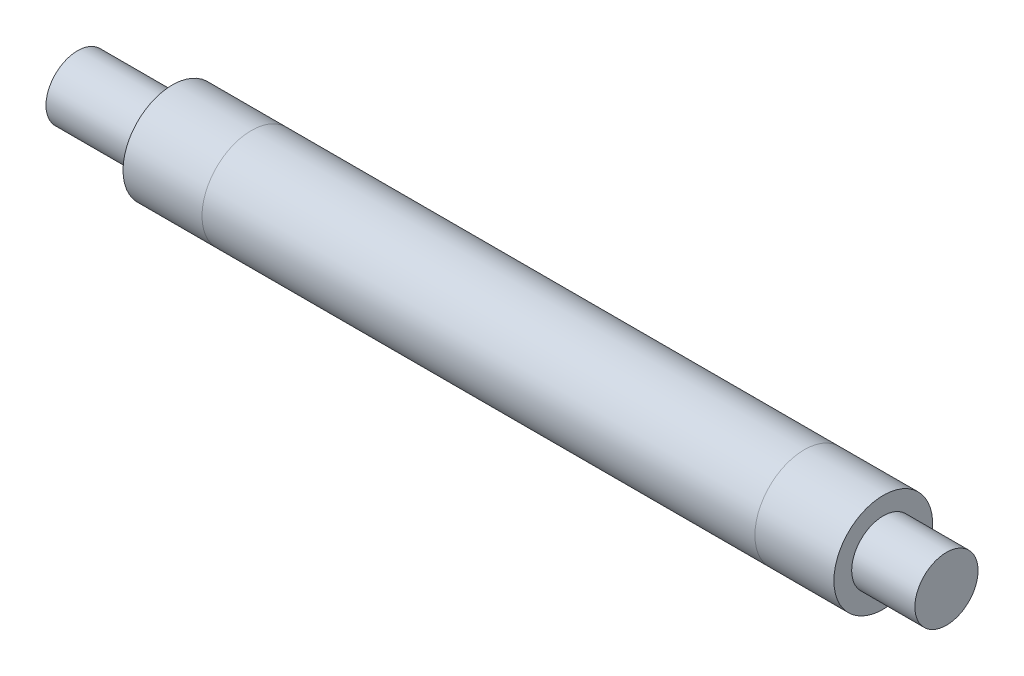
ISO-10303-21;
HEADER;
FILE_DESCRIPTION(('STEP AP214'),'2;1');
FILE_NAME('part.step','',(''),(''),'','','');
FILE_SCHEMA(('AUTOMOTIVE_DESIGN { 1 0 10303 214 1 1 1 1 }'));
ENDSEC;
DATA;
#1=APPLICATION_CONTEXT('core data for automotive mechanical design processes');
#2=APPLICATION_PROTOCOL_DEFINITION('international standard','automotive_design',2000,#1);
#3=PRODUCT_CONTEXT('',#1,'mechanical');
#4=PRODUCT('Part','Part','',(#3));
#5=PRODUCT_RELATED_PRODUCT_CATEGORY('part','',(#4));
#6=PRODUCT_DEFINITION_FORMATION('','',#4);
#7=PRODUCT_DEFINITION_CONTEXT('part definition',#1,'design');
#8=PRODUCT_DEFINITION('design','',#6,#7);
#9=PRODUCT_DEFINITION_SHAPE('','',#8);
#10=(LENGTH_UNIT() NAMED_UNIT(*) SI_UNIT(.MILLI.,.METRE.));
#11=(NAMED_UNIT(*) PLANE_ANGLE_UNIT() SI_UNIT($,.RADIAN.));
#12=(NAMED_UNIT(*) SI_UNIT($,.STERADIAN.) SOLID_ANGLE_UNIT());
#13=UNCERTAINTY_MEASURE_WITH_UNIT(LENGTH_MEASURE(1.E-05),#10,'distance_accuracy_value','');
#14=(GEOMETRIC_REPRESENTATION_CONTEXT(3) GLOBAL_UNCERTAINTY_ASSIGNED_CONTEXT((#13)) GLOBAL_UNIT_ASSIGNED_CONTEXT((#10,
#11,#12)) REPRESENTATION_CONTEXT('',''));
#15=CARTESIAN_POINT('',(0.,0.,0.));
#16=DIRECTION('',(0.,0.,1.));
#17=DIRECTION('',(1.,0.,0.));
#18=AXIS2_PLACEMENT_3D('',#15,#16,#17);
#19=CARTESIAN_POINT('',(0.,0.,0.));
#20=DIRECTION('',(-1.,0.,0.));
#21=DIRECTION('',(0.,0.,1.));
#22=AXIS2_PLACEMENT_3D('',#19,#20,#21);
#23=CYLINDRICAL_SURFACE('',#22,3.125);
#24=CARTESIAN_POINT('',(11.,0.,0.));
#25=DIRECTION('',(1.,0.,0.));
#26=DIRECTION('',(0.,1.,0.));
#27=AXIS2_PLACEMENT_3D('',#24,#25,#26);
#28=CIRCLE('',#27,3.125);
#29=CARTESIAN_POINT('',(11.,3.125,0.));
#30=VERTEX_POINT('',#29);
#31=EDGE_CURVE('E48',#30,#30,#28,.T.);
#32=ORIENTED_EDGE('',*,*,#31,.T.);
#33=EDGE_LOOP('',(#32));
#34=FACE_BOUND('',#33,.T.);
#35=CARTESIAN_POINT('',(46.,0.,0.));
#36=DIRECTION('',(1.,0.,0.));
#37=DIRECTION('',(0.,0.,-1.));
#38=AXIS2_PLACEMENT_3D('',#35,#36,#37);
#39=CIRCLE('',#38,3.125);
#40=CARTESIAN_POINT('',(46.,0.,-3.125));
#41=VERTEX_POINT('',#40);
#42=EDGE_CURVE('E10',#41,#41,#39,.T.);
#43=ORIENTED_EDGE('',*,*,#42,.F.);
#44=EDGE_LOOP('',(#43));
#45=FACE_BOUND('',#44,.T.);
#46=ADVANCED_FACE('F40',(#34,#45),#23,.T.);
#47=CARTESIAN_POINT('',(6.00000000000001,0.,0.));
#48=DIRECTION('',(-1.,0.,0.));
#49=DIRECTION('',(0.,0.,1.));
#50=AXIS2_PLACEMENT_3D('',#47,#48,#49);
#51=CIRCLE('',#50,3.125);
#52=CARTESIAN_POINT('',(6.00000000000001,0.,3.125));
#53=VERTEX_POINT('',#52);
#54=EDGE_CURVE('E66',#53,#53,#51,.T.);
#55=ORIENTED_EDGE('',*,*,#54,.F.);
#56=EDGE_LOOP('',(#55));
#57=FACE_BOUND('',#56,.T.);
#58=ORIENTED_EDGE('',*,*,#31,.F.);
#59=EDGE_LOOP('',(#58));
#60=FACE_BOUND('',#59,.T.);
#61=ADVANCED_FACE('F91',(#57,#60),#23,.T.);
#62=CARTESIAN_POINT('',(0.,0.,0.));
#63=DIRECTION('',(1.,0.,0.));
#64=DIRECTION('',(0.,0.,-1.));
#65=AXIS2_PLACEMENT_3D('',#62,#63,#64);
#66=PLANE('',#65);
#67=CARTESIAN_POINT('',(0.,0.,0.));
#68=DIRECTION('',(-1.,0.,0.));
#69=DIRECTION('',(0.,0.,1.));
#70=AXIS2_PLACEMENT_3D('',#67,#68,#69);
#71=CIRCLE('',#70,2.);
#72=CARTESIAN_POINT('',(0.,0.,2.));
#73=VERTEX_POINT('',#72);
#74=EDGE_CURVE('E55',#73,#73,#71,.T.);
#75=ORIENTED_EDGE('',*,*,#74,.T.);
#76=EDGE_LOOP('',(#75));
#77=FACE_BOUND('',#76,.T.);
#78=ADVANCED_FACE('F42',(#77),#66,.F.);
#79=CARTESIAN_POINT('',(0.,0.,0.));
#80=DIRECTION('',(-1.,0.,0.));
#81=DIRECTION('',(0.,0.,1.));
#82=AXIS2_PLACEMENT_3D('',#79,#80,#81);
#83=CYLINDRICAL_SURFACE('',#82,2.);
#84=ORIENTED_EDGE('',*,*,#74,.F.);
#85=EDGE_LOOP('',(#84));
#86=FACE_BOUND('',#85,.T.);
#87=CARTESIAN_POINT('',(6.00000000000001,0.,0.));
#88=DIRECTION('',(-1.,0.,0.));
#89=DIRECTION('',(0.,0.,1.));
#90=AXIS2_PLACEMENT_3D('',#87,#88,#89);
#91=CIRCLE('',#90,2.);
#92=CARTESIAN_POINT('',(6.00000000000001,0.,2.));
#93=VERTEX_POINT('',#92);
#94=EDGE_CURVE('E61',#93,#93,#91,.T.);
#95=ORIENTED_EDGE('',*,*,#94,.T.);
#96=EDGE_LOOP('',(#95));
#97=FACE_BOUND('',#96,.T.);
#98=ADVANCED_FACE('F108',(#86,#97),#83,.T.);
#99=CARTESIAN_POINT('',(6.00000000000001,2.,0.));
#100=DIRECTION('',(1.,0.,0.));
#101=DIRECTION('',(0.,0.,-1.));
#102=AXIS2_PLACEMENT_3D('',#99,#100,#101);
#103=PLANE('',#102);
#104=ORIENTED_EDGE('',*,*,#94,.F.);
#105=EDGE_LOOP('',(#104));
#106=FACE_BOUND('',#105,.T.);
#107=ORIENTED_EDGE('',*,*,#54,.T.);
#108=EDGE_LOOP('',(#107));
#109=FACE_BOUND('',#108,.T.);
#110=ADVANCED_FACE('F102',(#106,#109),#103,.F.);
#111=ORIENTED_EDGE('',*,*,#42,.T.);
#112=EDGE_LOOP('',(#111));
#113=FACE_BOUND('',#112,.T.);
#114=CARTESIAN_POINT('',(51.,0.,0.));
#115=DIRECTION('',(-1.,0.,0.));
#116=DIRECTION('',(0.,0.,1.));
#117=AXIS2_PLACEMENT_3D('',#114,#115,#116);
#118=CIRCLE('',#117,3.125);
#119=CARTESIAN_POINT('',(51.,0.,3.125));
#120=VERTEX_POINT('',#119);
#121=EDGE_CURVE('E69',#120,#120,#118,.T.);
#122=ORIENTED_EDGE('',*,*,#121,.T.);
#123=EDGE_LOOP('',(#122));
#124=FACE_BOUND('',#123,.T.);
#125=ADVANCED_FACE('F93',(#113,#124),#23,.T.);
#126=CARTESIAN_POINT('',(51.,3.125,0.));
#127=DIRECTION('',(-1.,0.,0.));
#128=DIRECTION('',(0.,0.,1.));
#129=AXIS2_PLACEMENT_3D('',#126,#127,#128);
#130=PLANE('',#129);
#131=ORIENTED_EDGE('',*,*,#121,.F.);
#132=EDGE_LOOP('',(#131));
#133=FACE_BOUND('',#132,.T.);
#134=CARTESIAN_POINT('',(51.,0.,0.));
#135=DIRECTION('',(-1.,0.,0.));
#136=DIRECTION('',(0.,0.,1.));
#137=AXIS2_PLACEMENT_3D('',#134,#135,#136);
#138=CIRCLE('',#137,2.);
#139=CARTESIAN_POINT('',(51.,0.,2.));
#140=VERTEX_POINT('',#139);
#141=EDGE_CURVE('E72',#140,#140,#138,.T.);
#142=ORIENTED_EDGE('',*,*,#141,.T.);
#143=EDGE_LOOP('',(#142));
#144=FACE_BOUND('',#143,.T.);
#145=ADVANCED_FACE('F87',(#133,#144),#130,.F.);
#146=CARTESIAN_POINT('',(0.,0.,0.));
#147=DIRECTION('',(-1.,0.,0.));
#148=DIRECTION('',(0.,0.,1.));
#149=AXIS2_PLACEMENT_3D('',#146,#147,#148);
#150=CYLINDRICAL_SURFACE('',#149,2.);
#151=ORIENTED_EDGE('',*,*,#141,.F.);
#152=EDGE_LOOP('',(#151));
#153=FACE_BOUND('',#152,.T.);
#154=CARTESIAN_POINT('',(55.,0.,0.));
#155=DIRECTION('',(-1.,0.,0.));
#156=DIRECTION('',(0.,0.,1.));
#157=AXIS2_PLACEMENT_3D('',#154,#155,#156);
#158=CIRCLE('',#157,2.);
#159=CARTESIAN_POINT('',(55.,0.,2.));
#160=VERTEX_POINT('',#159);
#161=EDGE_CURVE('E75',#160,#160,#158,.T.);
#162=ORIENTED_EDGE('',*,*,#161,.T.);
#163=EDGE_LOOP('',(#162));
#164=FACE_BOUND('',#163,.T.);
#165=ADVANCED_FACE('F79',(#153,#164),#150,.T.);
#166=CARTESIAN_POINT('',(55.,2.,0.));
#167=DIRECTION('',(-1.,0.,0.));
#168=DIRECTION('',(0.,0.,1.));
#169=AXIS2_PLACEMENT_3D('',#166,#167,#168);
#170=PLANE('',#169);
#171=ORIENTED_EDGE('',*,*,#161,.F.);
#172=EDGE_LOOP('',(#171));
#173=FACE_BOUND('',#172,.T.);
#174=ADVANCED_FACE('F81',(#173),#170,.F.);
#175=CLOSED_SHELL('',(#46,#61,#78,#98,#110,#125,#145,#165,#174));
#176=MANIFOLD_SOLID_BREP('B2',#175);
#177=ADVANCED_BREP_SHAPE_REPRESENTATION('',(#18,#176),#14);
#178=SHAPE_DEFINITION_REPRESENTATION(#9,#177);
ENDSEC;
END-ISO-10303-21;
